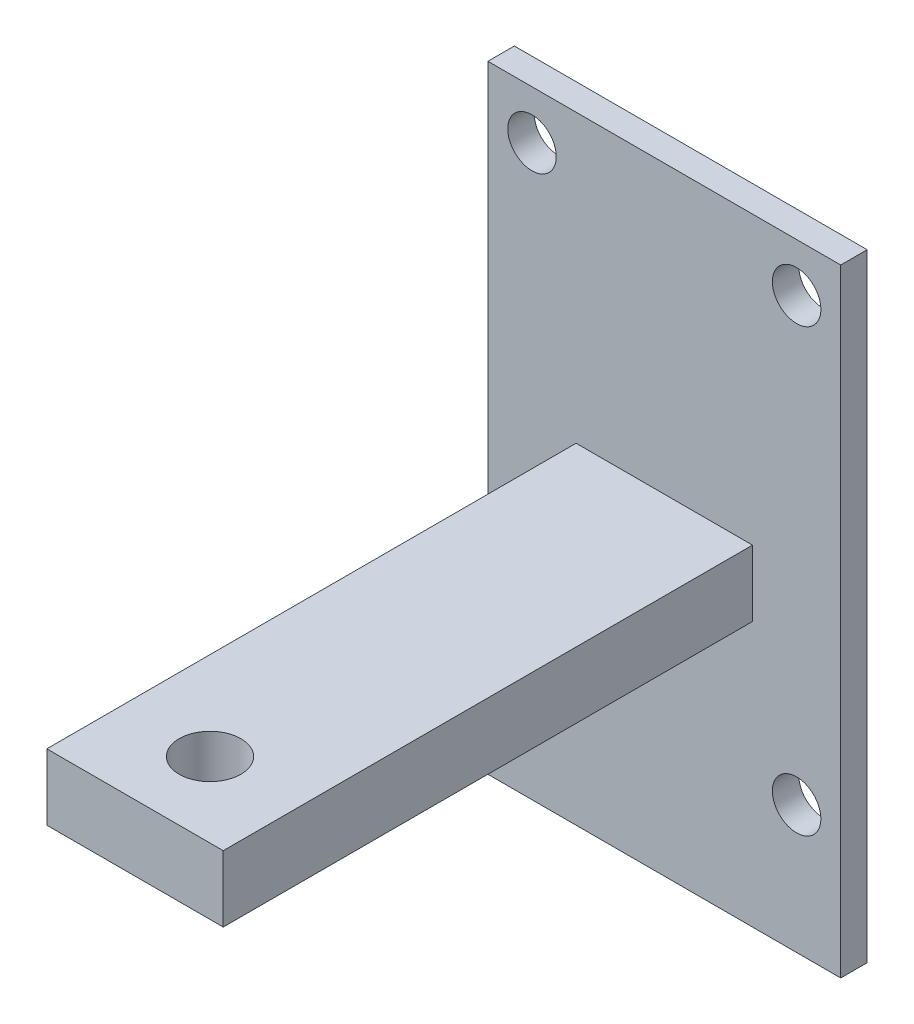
from build123d import *

# Parameters (mm, degrees)
ESQUISSE1_W             = 80
ESQUISSE1_H             = 140
BASE_EXTRUSION_DEPTH    = 6
ESQUISSE2_W             = 40
ESQUISSE2_H             = 15
BOSS_EXTRU_1_DEPTH      = 120
ESQUISSE3_R             = 7
ENL_V_MAT_EXTRU_1_DEPTH = 168.03592428
ESQUISSE4_R             = 5.5
ENL_V_MAT_EXTRU_2_DEPTH = 201.997512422


with BuildPart() as part:
    # Esquisse1 → Base-Extrusion (new body)
    with BuildSketch(Plane.XY):
        with Locations((40, 70)):
            Rectangle(ESQUISSE1_W, ESQUISSE1_H)
    extrude(amount=BASE_EXTRUSION_DEPTH)

    # Esquisse2 → Boss.-Extru.1 (add)
    with BuildSketch(Plane.XY.offset(6)):
        with Locations((40, 67.5)):
            Rectangle(ESQUISSE2_W, ESQUISSE2_H)
    extrude(amount=BOSS_EXTRU_1_DEPTH)

    # Esquisse3 → Enl_v. mat.-Extru.1 (cut, through all)
    with BuildSketch(Plane(origin=(0, 75, 0), x_dir=(-1, 0, 0), z_dir=(0, 1, 0))):
        with Locations(Location((-40, 109, 0), (0, 0, 90))):
            Circle(ESQUISSE3_R)
    extrude(amount=-ENL_V_MAT_EXTRU_1_DEPTH, mode=Mode.SUBTRACT)

    # Esquisse4 → Enl_v. mat.-Extru.2 (cut, through all)
    with BuildSketch(Plane.XY.offset(6)):
        with Locations((10, 129)):
            Circle(ESQUISSE4_R)
        with Locations((70, 129)):
            Circle(ESQUISSE4_R)
        with Locations((70, 29)):
            Circle(ESQUISSE4_R)
        with Locations((10, 29)):
            Circle(ESQUISSE4_R)
    extrude(amount=-ENL_V_MAT_EXTRU_2_DEPTH, mode=Mode.SUBTRACT)


solid = part.part
